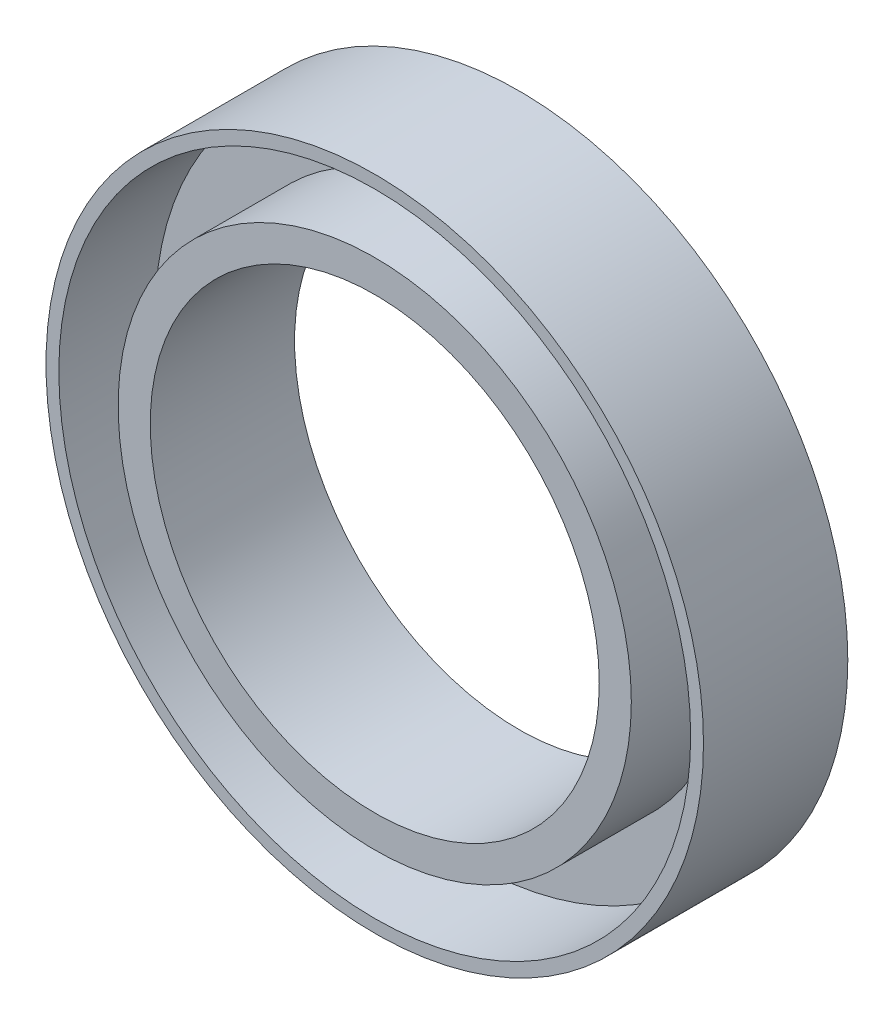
ISO-10303-21;
HEADER;
FILE_DESCRIPTION(('STEP AP214'),'2;1');
FILE_NAME('part.step','',(''),(''),'','','');
FILE_SCHEMA(('AUTOMOTIVE_DESIGN { 1 0 10303 214 1 1 1 1 }'));
ENDSEC;
DATA;
#1=APPLICATION_CONTEXT('core data for automotive mechanical design processes');
#2=APPLICATION_PROTOCOL_DEFINITION('international standard','automotive_design',2000,#1);
#3=PRODUCT_CONTEXT('',#1,'mechanical');
#4=PRODUCT('Part','Part','',(#3));
#5=PRODUCT_RELATED_PRODUCT_CATEGORY('part','',(#4));
#6=PRODUCT_DEFINITION_FORMATION('','',#4);
#7=PRODUCT_DEFINITION_CONTEXT('part definition',#1,'design');
#8=PRODUCT_DEFINITION('design','',#6,#7);
#9=PRODUCT_DEFINITION_SHAPE('','',#8);
#10=(LENGTH_UNIT() NAMED_UNIT(*) SI_UNIT(.MILLI.,.METRE.));
#11=(NAMED_UNIT(*) PLANE_ANGLE_UNIT() SI_UNIT($,.RADIAN.));
#12=(NAMED_UNIT(*) SI_UNIT($,.STERADIAN.) SOLID_ANGLE_UNIT());
#13=UNCERTAINTY_MEASURE_WITH_UNIT(LENGTH_MEASURE(1.E-05),#10,'distance_accuracy_value','');
#14=(GEOMETRIC_REPRESENTATION_CONTEXT(3) GLOBAL_UNCERTAINTY_ASSIGNED_CONTEXT((#13)) GLOBAL_UNIT_ASSIGNED_CONTEXT((#10,
#11,#12)) REPRESENTATION_CONTEXT('',''));
#15=CARTESIAN_POINT('',(0.,0.,0.));
#16=DIRECTION('',(0.,0.,1.));
#17=DIRECTION('',(1.,0.,0.));
#18=AXIS2_PLACEMENT_3D('',#15,#16,#17);
#19=CARTESIAN_POINT('',(0.,0.,1.5));
#20=DIRECTION('',(0.,0.,1.));
#21=DIRECTION('',(1.,0.,0.));
#22=AXIS2_PLACEMENT_3D('',#19,#20,#21);
#23=PLANE('',#22);
#24=CARTESIAN_POINT('',(0.,0.,1.5));
#25=DIRECTION('',(0.,0.,1.));
#26=DIRECTION('',(1.,0.,0.));
#27=AXIS2_PLACEMENT_3D('',#24,#25,#26);
#28=CIRCLE('',#27,8.);
#29=CARTESIAN_POINT('',(8.,0.,1.5));
#30=VERTEX_POINT('',#29);
#31=EDGE_CURVE('E49',#30,#30,#28,.T.);
#32=ORIENTED_EDGE('',*,*,#31,.F.);
#33=EDGE_LOOP('',(#32));
#34=FACE_BOUND('',#33,.T.);
#35=CARTESIAN_POINT('',(0.,0.,1.5));
#36=DIRECTION('',(0.,0.,1.));
#37=DIRECTION('',(1.,0.,0.));
#38=AXIS2_PLACEMENT_3D('',#35,#36,#37);
#39=CIRCLE('',#38,9.85);
#40=CARTESIAN_POINT('',(9.85,0.,1.5));
#41=VERTEX_POINT('',#40);
#42=EDGE_CURVE('E10',#41,#41,#39,.F.);
#43=ORIENTED_EDGE('',*,*,#42,.F.);
#44=EDGE_LOOP('',(#43));
#45=FACE_BOUND('',#44,.T.);
#46=ADVANCED_FACE('F31',(#34,#45),#23,.T.);
#47=CARTESIAN_POINT('',(0.,0.,0.));
#48=DIRECTION('',(0.,0.,1.));
#49=DIRECTION('',(1.,0.,0.));
#50=AXIS2_PLACEMENT_3D('',#47,#48,#49);
#51=PLANE('',#50);
#52=CARTESIAN_POINT('',(0.,0.,0.));
#53=DIRECTION('',(0.,0.,1.));
#54=DIRECTION('',(1.,0.,0.));
#55=AXIS2_PLACEMENT_3D('',#52,#53,#54);
#56=CIRCLE('',#55,10.25);
#57=CARTESIAN_POINT('',(10.25,0.,0.));
#58=VERTEX_POINT('',#57);
#59=EDGE_CURVE('E38',#58,#58,#56,.T.);
#60=ORIENTED_EDGE('',*,*,#59,.F.);
#61=EDGE_LOOP('',(#60));
#62=FACE_BOUND('',#61,.T.);
#63=CARTESIAN_POINT('',(0.,0.,0.));
#64=DIRECTION('',(0.,0.,1.));
#65=DIRECTION('',(1.,0.,0.));
#66=AXIS2_PLACEMENT_3D('',#63,#64,#65);
#67=CIRCLE('',#66,7.);
#68=CARTESIAN_POINT('',(7.,0.,0.));
#69=VERTEX_POINT('',#68);
#70=EDGE_CURVE('E42',#69,#69,#67,.T.);
#71=ORIENTED_EDGE('',*,*,#70,.T.);
#72=EDGE_LOOP('',(#71));
#73=FACE_BOUND('',#72,.T.);
#74=ADVANCED_FACE('F81',(#62,#73),#51,.F.);
#75=CARTESIAN_POINT('',(0.,0.,1.5));
#76=DIRECTION('',(0.,0.,-1.));
#77=DIRECTION('',(-1.,0.,0.));
#78=AXIS2_PLACEMENT_3D('',#75,#76,#77);
#79=CYLINDRICAL_SURFACE('',#78,10.25);
#80=ORIENTED_EDGE('',*,*,#59,.T.);
#81=EDGE_LOOP('',(#80));
#82=FACE_BOUND('',#81,.T.);
#83=CARTESIAN_POINT('',(0.,0.,4.5));
#84=DIRECTION('',(0.,0.,1.));
#85=DIRECTION('',(1.,0.,0.));
#86=AXIS2_PLACEMENT_3D('',#83,#84,#85);
#87=CIRCLE('',#86,10.25);
#88=CARTESIAN_POINT('',(10.25,0.,4.5));
#89=VERTEX_POINT('',#88);
#90=EDGE_CURVE('E57',#89,#89,#87,.T.);
#91=ORIENTED_EDGE('',*,*,#90,.F.);
#92=EDGE_LOOP('',(#91));
#93=FACE_BOUND('',#92,.T.);
#94=ADVANCED_FACE('F33',(#82,#93),#79,.T.);
#95=CARTESIAN_POINT('',(0.,0.,1.5));
#96=DIRECTION('',(0.,0.,-1.));
#97=DIRECTION('',(-1.,0.,0.));
#98=AXIS2_PLACEMENT_3D('',#95,#96,#97);
#99=CYLINDRICAL_SURFACE('',#98,7.);
#100=ORIENTED_EDGE('',*,*,#70,.F.);
#101=EDGE_LOOP('',(#100));
#102=FACE_BOUND('',#101,.T.);
#103=CARTESIAN_POINT('',(0.,0.,4.5));
#104=DIRECTION('',(0.,0.,1.));
#105=DIRECTION('',(1.,0.,0.));
#106=AXIS2_PLACEMENT_3D('',#103,#104,#105);
#107=CIRCLE('',#106,7.);
#108=CARTESIAN_POINT('',(7.,0.,4.5));
#109=VERTEX_POINT('',#108);
#110=EDGE_CURVE('E52',#109,#109,#107,.T.);
#111=ORIENTED_EDGE('',*,*,#110,.T.);
#112=EDGE_LOOP('',(#111));
#113=FACE_BOUND('',#112,.T.);
#114=ADVANCED_FACE('F91',(#102,#113),#99,.F.);
#115=CARTESIAN_POINT('',(0.,0.,4.5));
#116=DIRECTION('',(0.,0.,1.));
#117=DIRECTION('',(1.,0.,0.));
#118=AXIS2_PLACEMENT_3D('',#115,#116,#117);
#119=PLANE('',#118);
#120=CARTESIAN_POINT('',(0.,0.,4.5));
#121=DIRECTION('',(0.,0.,1.));
#122=DIRECTION('',(1.,0.,0.));
#123=AXIS2_PLACEMENT_3D('',#120,#121,#122);
#124=CIRCLE('',#123,8.);
#125=CARTESIAN_POINT('',(8.,0.,4.5));
#126=VERTEX_POINT('',#125);
#127=EDGE_CURVE('E46',#126,#126,#124,.T.);
#128=ORIENTED_EDGE('',*,*,#127,.T.);
#129=EDGE_LOOP('',(#128));
#130=FACE_BOUND('',#129,.T.);
#131=ORIENTED_EDGE('',*,*,#110,.F.);
#132=EDGE_LOOP('',(#131));
#133=FACE_BOUND('',#132,.T.);
#134=ADVANCED_FACE('F76',(#130,#133),#119,.T.);
#135=CARTESIAN_POINT('',(0.,0.,4.5));
#136=DIRECTION('',(0.,0.,-1.));
#137=DIRECTION('',(-1.,0.,0.));
#138=AXIS2_PLACEMENT_3D('',#135,#136,#137);
#139=CYLINDRICAL_SURFACE('',#138,8.);
#140=ORIENTED_EDGE('',*,*,#127,.F.);
#141=EDGE_LOOP('',(#140));
#142=FACE_BOUND('',#141,.T.);
#143=ORIENTED_EDGE('',*,*,#31,.T.);
#144=EDGE_LOOP('',(#143));
#145=FACE_BOUND('',#144,.T.);
#146=ADVANCED_FACE('F68',(#142,#145),#139,.T.);
#147=CARTESIAN_POINT('',(0.,0.,4.5));
#148=DIRECTION('',(0.,0.,1.));
#149=DIRECTION('',(1.,0.,0.));
#150=AXIS2_PLACEMENT_3D('',#147,#148,#149);
#151=PLANE('',#150);
#152=ORIENTED_EDGE('',*,*,#90,.T.);
#153=EDGE_LOOP('',(#152));
#154=FACE_BOUND('',#153,.T.);
#155=CARTESIAN_POINT('',(0.,0.,4.5));
#156=DIRECTION('',(0.,0.,1.));
#157=DIRECTION('',(1.,0.,0.));
#158=AXIS2_PLACEMENT_3D('',#155,#156,#157);
#159=CIRCLE('',#158,9.85);
#160=CARTESIAN_POINT('',(9.85,0.,4.5));
#161=VERTEX_POINT('',#160);
#162=EDGE_CURVE('E60',#161,#161,#159,.T.);
#163=ORIENTED_EDGE('',*,*,#162,.F.);
#164=EDGE_LOOP('',(#163));
#165=FACE_BOUND('',#164,.T.);
#166=ADVANCED_FACE('F66',(#154,#165),#151,.T.);
#167=CARTESIAN_POINT('',(0.,0.,4.5));
#168=DIRECTION('',(0.,0.,-1.));
#169=DIRECTION('',(-1.,0.,0.));
#170=AXIS2_PLACEMENT_3D('',#167,#168,#169);
#171=CYLINDRICAL_SURFACE('',#170,9.85);
#172=ORIENTED_EDGE('',*,*,#162,.T.);
#173=EDGE_LOOP('',(#172));
#174=FACE_BOUND('',#173,.T.);
#175=ORIENTED_EDGE('',*,*,#42,.T.);
#176=EDGE_LOOP('',(#175));
#177=FACE_BOUND('',#176,.T.);
#178=ADVANCED_FACE('F64',(#174,#177),#171,.F.);
#179=CLOSED_SHELL('',(#46,#74,#94,#114,#134,#146,#166,#178));
#180=MANIFOLD_SOLID_BREP('B2',#179);
#181=ADVANCED_BREP_SHAPE_REPRESENTATION('',(#18,#180),#14);
#182=SHAPE_DEFINITION_REPRESENTATION(#9,#181);
ENDSEC;
END-ISO-10303-21;
